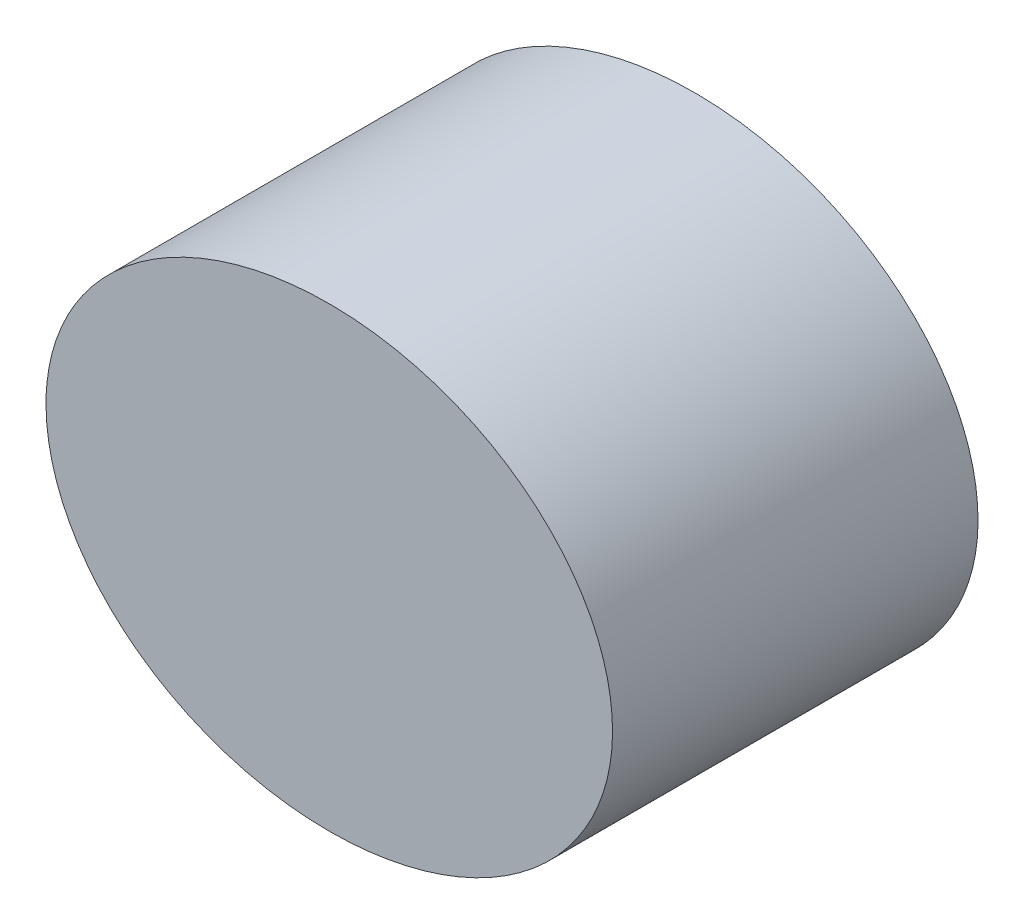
ISO-10303-21;
HEADER;
FILE_DESCRIPTION(('STEP AP214'),'2;1');
FILE_NAME('part.step','',(''),(''),'','','');
FILE_SCHEMA(('AUTOMOTIVE_DESIGN { 1 0 10303 214 1 1 1 1 }'));
ENDSEC;
DATA;
#1=APPLICATION_CONTEXT('core data for automotive mechanical design processes');
#2=APPLICATION_PROTOCOL_DEFINITION('international standard','automotive_design',2000,#1);
#3=PRODUCT_CONTEXT('',#1,'mechanical');
#4=PRODUCT('Part','Part','',(#3));
#5=PRODUCT_RELATED_PRODUCT_CATEGORY('part','',(#4));
#6=PRODUCT_DEFINITION_FORMATION('','',#4);
#7=PRODUCT_DEFINITION_CONTEXT('part definition',#1,'design');
#8=PRODUCT_DEFINITION('design','',#6,#7);
#9=PRODUCT_DEFINITION_SHAPE('','',#8);
#10=(LENGTH_UNIT() NAMED_UNIT(*) SI_UNIT(.MILLI.,.METRE.));
#11=(NAMED_UNIT(*) PLANE_ANGLE_UNIT() SI_UNIT($,.RADIAN.));
#12=(NAMED_UNIT(*) SI_UNIT($,.STERADIAN.) SOLID_ANGLE_UNIT());
#13=UNCERTAINTY_MEASURE_WITH_UNIT(LENGTH_MEASURE(1.E-05),#10,'distance_accuracy_value','');
#14=(GEOMETRIC_REPRESENTATION_CONTEXT(3) GLOBAL_UNCERTAINTY_ASSIGNED_CONTEXT((#13)) GLOBAL_UNIT_ASSIGNED_CONTEXT((#10,
#11,#12)) REPRESENTATION_CONTEXT('',''));
#15=CARTESIAN_POINT('',(0.,0.,0.));
#16=DIRECTION('',(0.,0.,1.));
#17=DIRECTION('',(1.,0.,0.));
#18=AXIS2_PLACEMENT_3D('',#15,#16,#17);
#19=CARTESIAN_POINT('',(0.,0.,20.));
#20=DIRECTION('',(0.,0.,1.));
#21=DIRECTION('',(-1.,0.,0.));
#22=AXIS2_PLACEMENT_3D('',#19,#20,#21);
#23=ELLIPSE('',#22,15.5,12.5);
#24=DIRECTION('',(0.,0.,-1.));
#25=VECTOR('',#24,1.);
#26=SURFACE_OF_LINEAR_EXTRUSION('',#23,#25);
#27=CARTESIAN_POINT('',(-15.5,0.,20.));
#28=VERTEX_POINT('',#27);
#29=EDGE_CURVE('E10',#28,#28,#23,.T.);
#30=ORIENTED_EDGE('',*,*,#29,.F.);
#31=EDGE_LOOP('',(#30));
#32=FACE_BOUND('',#31,.T.);
#33=CARTESIAN_POINT('',(0.,0.,0.));
#34=DIRECTION('',(0.,0.,1.));
#35=DIRECTION('',(-1.,0.,0.));
#36=AXIS2_PLACEMENT_3D('',#33,#34,#35);
#37=ELLIPSE('',#36,15.5,12.5);
#38=CARTESIAN_POINT('',(-15.5,0.,0.));
#39=VERTEX_POINT('',#38);
#40=EDGE_CURVE('E41',#39,#39,#37,.T.);
#41=ORIENTED_EDGE('',*,*,#40,.T.);
#42=EDGE_LOOP('',(#41));
#43=FACE_BOUND('',#42,.T.);
#44=ADVANCED_FACE('F37',(#32,#43),#26,.F.);
#45=CARTESIAN_POINT('',(0.,0.,20.));
#46=DIRECTION('',(0.,0.,1.));
#47=DIRECTION('',(1.,0.,0.));
#48=AXIS2_PLACEMENT_3D('',#45,#46,#47);
#49=PLANE('',#48);
#50=ORIENTED_EDGE('',*,*,#29,.T.);
#51=EDGE_LOOP('',(#50));
#52=FACE_BOUND('',#51,.T.);
#53=ADVANCED_FACE('F55',(#52),#49,.T.);
#54=CARTESIAN_POINT('',(0.,0.,0.));
#55=DIRECTION('',(0.,0.,1.));
#56=DIRECTION('',(1.,0.,0.));
#57=AXIS2_PLACEMENT_3D('',#54,#55,#56);
#58=PLANE('',#57);
#59=ORIENTED_EDGE('',*,*,#40,.F.);
#60=EDGE_LOOP('',(#59));
#61=FACE_BOUND('',#60,.T.);
#62=ADVANCED_FACE('F53',(#61),#58,.F.);
#63=CLOSED_SHELL('',(#44,#53,#62));
#64=MANIFOLD_SOLID_BREP('B2',#63);
#65=ADVANCED_BREP_SHAPE_REPRESENTATION('',(#18,#64),#14);
#66=SHAPE_DEFINITION_REPRESENTATION(#9,#65);
ENDSEC;
END-ISO-10303-21;
